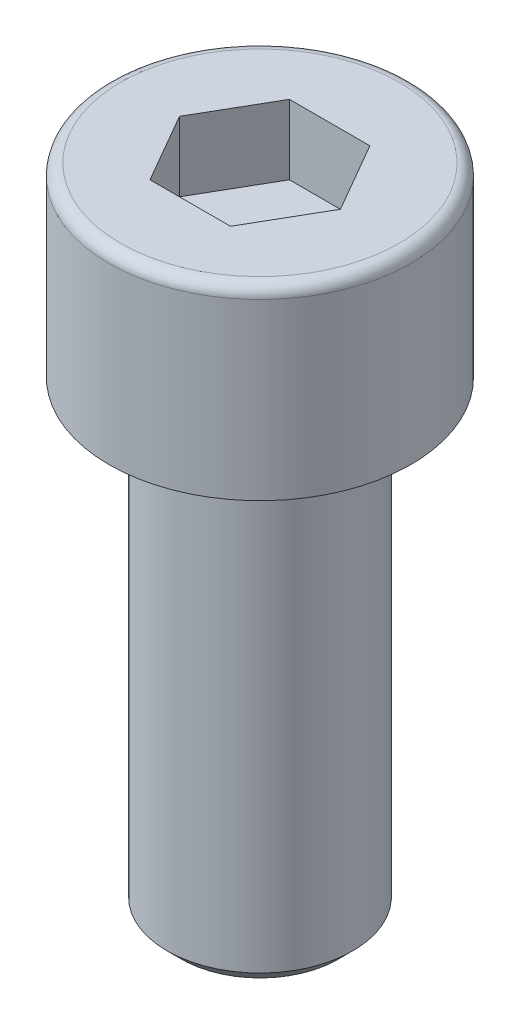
from build123d import *

# Parameters (mm, degrees)
CHANFREIN1_SIZE         = 0.625
ENL_V_MAT_EXTRU_3_DEPTH = 3


with BuildPart() as part:
    # Esquisse1 → Base-R_volution (revolve)
    with BuildSketch(Plane.XY, mode=Mode.PRIVATE) as base_r_volution_sk:
        with BuildLine():
            Line((0, 28), (-6, 28))
            ThreePointArc((-6, 28), (-6.353553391, 27.853553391), (-6.5, 27.5))
            Line((-6.5, 27.5), (-6.5, 20))
            Line((-6.5, 20), (-4, 20))
            Line((-4, 20), (-4, 0))
            Line((-4, 0), (0, 0))
            Line((0, 0), (0, 28))
        make_face()
    revolve(base_r_volution_sk.sketch.rotate(Axis((0, 50, 0), (0, -1, 0)), 270), axis=Axis((0, 50, 0), (0, -1, 0)))

    # Chanfrein1
    chanfrein1_edges = [part.edges().sort_by_distance(p)[0] for p in [
        (0, 0, -4),
    ]]
    chamfer(chanfrein1_edges, length=CHANFREIN1_SIZE)

    # Esquisse4 → Enl_v. mat.-Extru.3 (cut)
    with BuildSketch(Plane(origin=(0, 28, 0), x_dir=(-1, 0, 0), z_dir=(0, 1, 0))):
        Polygon((3.464101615, 0), (1.732050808, 3), (-1.732050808, 3), (-3.464101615, 0), (-1.732050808, -3), (1.732050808, -3), align=None)
    extrude(amount=-ENL_V_MAT_EXTRU_3_DEPTH, mode=Mode.SUBTRACT)


solid = part.part
